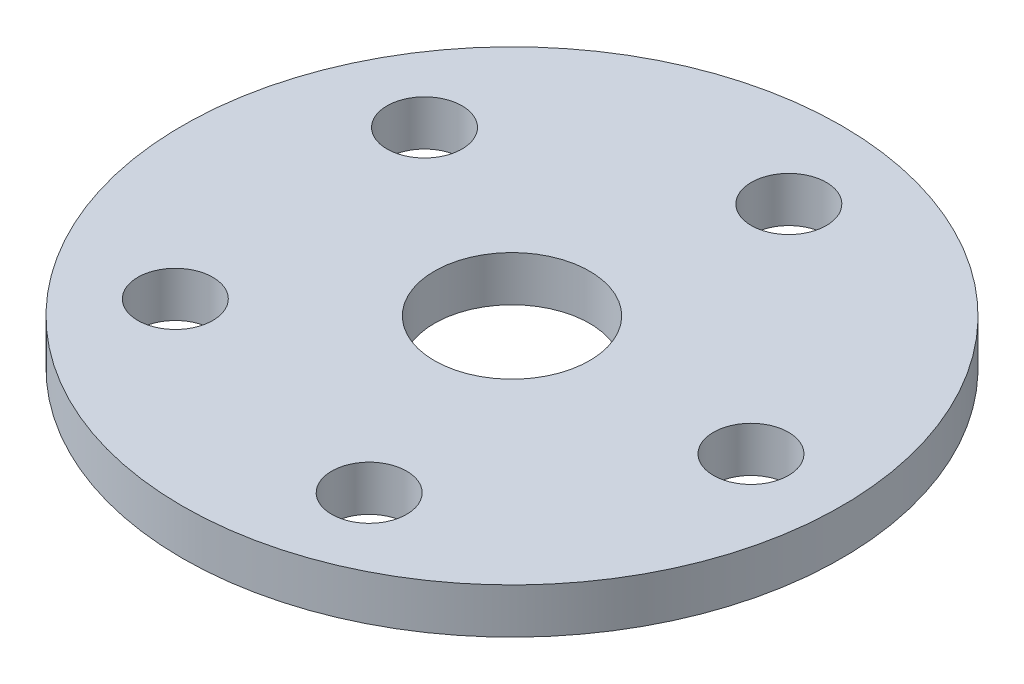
from build123d import *

# Parameters (mm, degrees)
SKETCH1_R          = 64.755865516
EXTRUDE1_DEPTH     = 8.89
SKETCH2_R          = 7.366886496
CUT_EXTRUDE1_DEPTH = 8.89
SKETCH3_R          = 15.246091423
CUT_EXTRUDE2_DEPTH = 8.89
CIRPATTERN2_COUNT  = 5
CIRPATTERN2_ANGLE  = 280


with BuildPart() as part:
    # Sketch1 → Extrude1 (new body)
    with BuildSketch(Plane(origin=(0, 0, 0), x_dir=(1, 0, 0), z_dir=(0, 1, 0))):
        with Locations(Location((0, 0, 0), (0, 0, 270))):
            Circle(SKETCH1_R)
    extrude(amount=EXTRUDE1_DEPTH)

    # Sketch2 → Cut-Extrude1 (cut)
    with BuildSketch(Plane(origin=(0, 8.89, 0), x_dir=(-1, 0, 0), z_dir=(0, 1, 0))):
        with Locations(Location((-46.957163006, 0, 0), (0, 0, 90))):
            Circle(SKETCH2_R)
    cut_extrude1 = extrude(amount=-CUT_EXTRUDE1_DEPTH, mode=Mode.SUBTRACT)

    # Sketch3 → Cut-Extrude2 (cut)
    with BuildSketch(Plane(origin=(0, 8.89, 0), x_dir=(-1, 0, 0), z_dir=(0, 1, 0))):
        with Locations(Location((0, 0, 0), (0, 0, 90))):
            Circle(SKETCH3_R)
    extrude(amount=-CUT_EXTRUDE2_DEPTH, mode=Mode.SUBTRACT)

    # CirPattern2: Cut-Extrude1 ×5 about axis
    cirpattern2_axis = Axis((0, 0, 0), (0, -1, 0))
    for i in range(1, CIRPATTERN2_COUNT):
        add(cut_extrude1.rotate(cirpattern2_axis, i * CIRPATTERN2_ANGLE / (CIRPATTERN2_COUNT - 1)), mode=Mode.SUBTRACT)


solid = part.part
